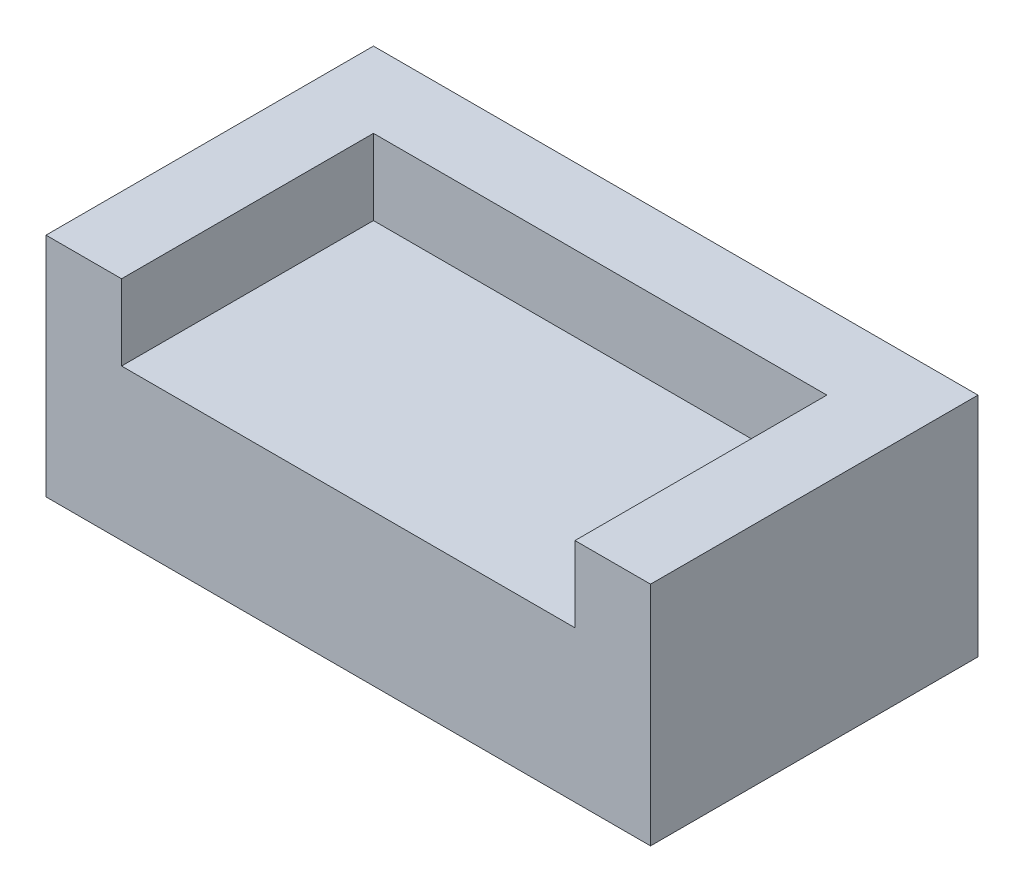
from build123d import *

# Parameters (mm, degrees)
SKETCH_1_W      = 90
SKETCH_1_H      = 50
EXTRUDE_1_DEPTH = 30
EXTRUDE_2_DEPTH = 45


with BuildPart() as part:
    # Sketch 1 → Extrude 1 (new body)
    with BuildSketch(Plane(origin=(0, 0, 0), x_dir=(1, 0, 0), z_dir=(0, 1, 0))):
        with Locations((0, -40)):
            Rectangle(SKETCH_1_W, SKETCH_1_H)
    extrude(amount=EXTRUDE_1_DEPTH)

    # Sketch 1_3 → Extrude 2 (add)
    with BuildSketch(Plane(origin=(0, 0, 0), x_dir=(1, 0, 0), z_dir=(0, 1, 0))):
        Polygon((60, 0), (-60, 0), (-60, -65), (-45, -65), (-45, -15), (45, -15), (45, -65), (60, -65), align=None)
    extrude(amount=EXTRUDE_2_DEPTH)


solid = part.part
